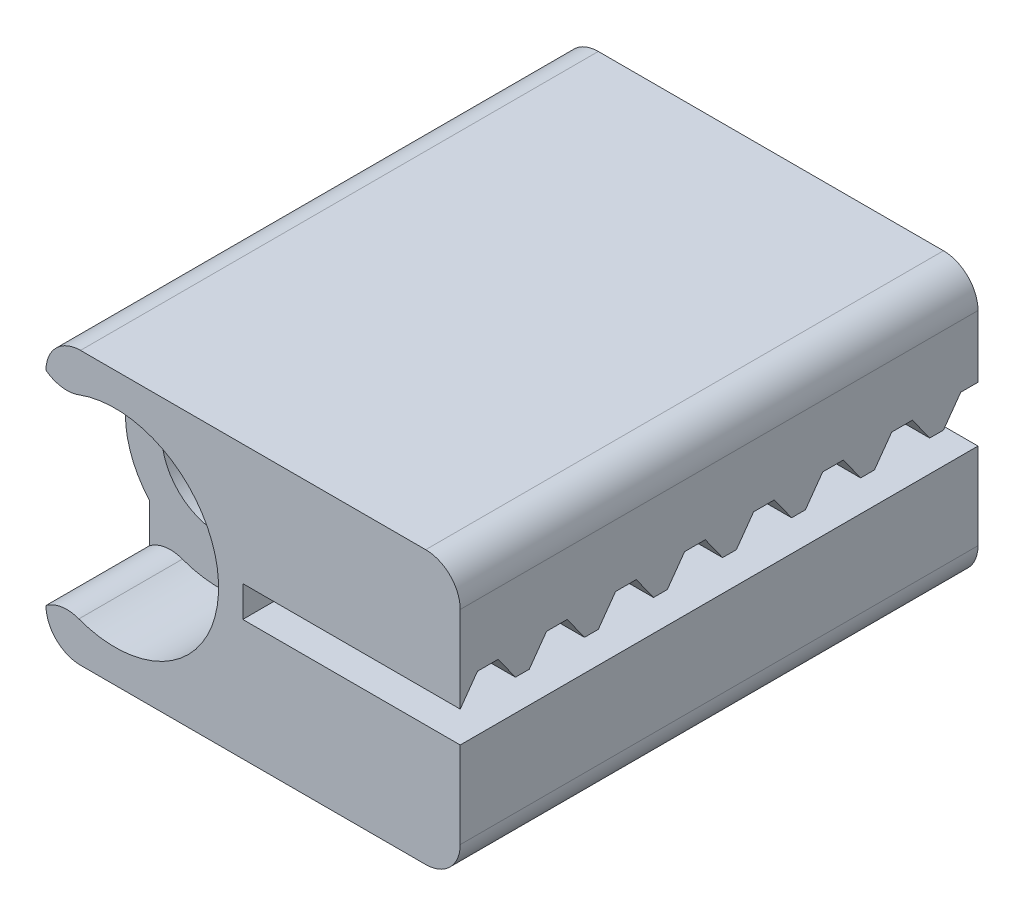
ISO-10303-21;
HEADER;
FILE_DESCRIPTION(('STEP AP214'),'2;1');
FILE_NAME('part.step','',(''),(''),'','','');
FILE_SCHEMA(('AUTOMOTIVE_DESIGN { 1 0 10303 214 1 1 1 1 }'));
ENDSEC;
DATA;
#1=APPLICATION_CONTEXT('core data for automotive mechanical design processes');
#2=APPLICATION_PROTOCOL_DEFINITION('international standard','automotive_design',2000,#1);
#3=PRODUCT_CONTEXT('',#1,'mechanical');
#4=PRODUCT('Part','Part','',(#3));
#5=PRODUCT_RELATED_PRODUCT_CATEGORY('part','',(#4));
#6=PRODUCT_DEFINITION_FORMATION('','',#4);
#7=PRODUCT_DEFINITION_CONTEXT('part definition',#1,'design');
#8=PRODUCT_DEFINITION('design','',#6,#7);
#9=PRODUCT_DEFINITION_SHAPE('','',#8);
#10=(LENGTH_UNIT() NAMED_UNIT(*) SI_UNIT(.MILLI.,.METRE.));
#11=(NAMED_UNIT(*) PLANE_ANGLE_UNIT() SI_UNIT($,.RADIAN.));
#12=(NAMED_UNIT(*) SI_UNIT($,.STERADIAN.) SOLID_ANGLE_UNIT());
#13=UNCERTAINTY_MEASURE_WITH_UNIT(LENGTH_MEASURE(1.E-05),#10,'distance_accuracy_value','');
#14=(GEOMETRIC_REPRESENTATION_CONTEXT(3) GLOBAL_UNCERTAINTY_ASSIGNED_CONTEXT((#13)) GLOBAL_UNIT_ASSIGNED_CONTEXT((#10,
#11,#12)) REPRESENTATION_CONTEXT('',''));
#15=CARTESIAN_POINT('',(0.,0.,0.));
#16=DIRECTION('',(0.,0.,1.));
#17=DIRECTION('',(1.,0.,0.));
#18=AXIS2_PLACEMENT_3D('',#15,#16,#17);
#19=CARTESIAN_POINT('',(6.,0.45,0.));
#20=DIRECTION('',(0.,1.,0.));
#21=DIRECTION('',(0.,0.,1.));
#22=AXIS2_PLACEMENT_3D('',#19,#20,#21);
#23=PLANE('',#22);
#24=DIRECTION('',(0.,0.,1.));
#25=VECTOR('',#24,1.);
#26=CARTESIAN_POINT('',(-0.299999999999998,0.45,0.));
#27=LINE('',#26,#25);
#28=CARTESIAN_POINT('',(-0.299999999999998,0.45,0.999999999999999));
#29=VERTEX_POINT('',#28);
#30=CARTESIAN_POINT('',(-0.299999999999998,0.45,1.4));
#31=VERTEX_POINT('',#30);
#32=EDGE_CURVE('E551',#29,#31,#27,.T.);
#33=ORIENTED_EDGE('',*,*,#32,.F.);
#34=DIRECTION('',(1.,0.,0.));
#35=VECTOR('',#34,1.);
#36=CARTESIAN_POINT('',(-15.3850919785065,0.45,0.999999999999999));
#37=LINE('',#36,#35);
#38=CARTESIAN_POINT('',(6.,0.45,0.999999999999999));
#39=VERTEX_POINT('',#38);
#40=EDGE_CURVE('E496',#29,#39,#37,.T.);
#41=ORIENTED_EDGE('',*,*,#40,.T.);
#42=DIRECTION('',(0.,0.,1.));
#43=VECTOR('',#42,1.);
#44=CARTESIAN_POINT('',(6.,0.45,0.));
#45=LINE('',#44,#43);
#46=CARTESIAN_POINT('',(6.,0.45,1.4));
#47=VERTEX_POINT('',#46);
#48=EDGE_CURVE('E550',#39,#47,#45,.T.);
#49=ORIENTED_EDGE('',*,*,#48,.T.);
#50=DIRECTION('',(1.,0.,0.));
#51=VECTOR('',#50,1.);
#52=CARTESIAN_POINT('',(-15.3850919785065,0.45,1.4));
#53=LINE('',#52,#51);
#54=EDGE_CURVE('E492',#31,#47,#53,.T.);
#55=ORIENTED_EDGE('',*,*,#54,.F.);
#56=EDGE_LOOP('',(#33,#41,#49,#55));
#57=FACE_BOUND('',#56,.T.);
#58=ADVANCED_FACE('F32',(#57),#23,.F.);
#59=CARTESIAN_POINT('',(-0.299999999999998,0.45,3.));
#60=VERTEX_POINT('',#59);
#61=CARTESIAN_POINT('',(-0.299999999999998,0.45,3.4));
#62=VERTEX_POINT('',#61);
#63=EDGE_CURVE('E719',#60,#62,#27,.T.);
#64=ORIENTED_EDGE('',*,*,#63,.F.);
#65=DIRECTION('',(1.,0.,0.));
#66=VECTOR('',#65,1.);
#67=CARTESIAN_POINT('',(-15.3850919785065,0.45,3.));
#68=LINE('',#67,#66);
#69=CARTESIAN_POINT('',(6.,0.45,3.));
#70=VERTEX_POINT('',#69);
#71=EDGE_CURVE('E483',#60,#70,#68,.T.);
#72=ORIENTED_EDGE('',*,*,#71,.T.);
#73=CARTESIAN_POINT('',(6.,0.45,3.4));
#74=VERTEX_POINT('',#73);
#75=EDGE_CURVE('E1234',#70,#74,#45,.T.);
#76=ORIENTED_EDGE('',*,*,#75,.T.);
#77=DIRECTION('',(1.,0.,0.));
#78=VECTOR('',#77,1.);
#79=CARTESIAN_POINT('',(-15.3850919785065,0.45,3.4));
#80=LINE('',#79,#78);
#81=EDGE_CURVE('E479',#62,#74,#80,.T.);
#82=ORIENTED_EDGE('',*,*,#81,.F.);
#83=EDGE_LOOP('',(#64,#72,#76,#82));
#84=FACE_BOUND('',#83,.T.);
#85=ADVANCED_FACE('F793',(#84),#23,.F.);
#86=CARTESIAN_POINT('',(-0.299999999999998,0.45,5.));
#87=VERTEX_POINT('',#86);
#88=CARTESIAN_POINT('',(-0.299999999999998,0.45,5.4));
#89=VERTEX_POINT('',#88);
#90=EDGE_CURVE('E721',#87,#89,#27,.T.);
#91=ORIENTED_EDGE('',*,*,#90,.F.);
#92=DIRECTION('',(1.,0.,0.));
#93=VECTOR('',#92,1.);
#94=CARTESIAN_POINT('',(-15.3850919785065,0.45,5.));
#95=LINE('',#94,#93);
#96=CARTESIAN_POINT('',(6.,0.45,5.));
#97=VERTEX_POINT('',#96);
#98=EDGE_CURVE('E470',#87,#97,#95,.T.);
#99=ORIENTED_EDGE('',*,*,#98,.T.);
#100=CARTESIAN_POINT('',(6.,0.45,5.4));
#101=VERTEX_POINT('',#100);
#102=EDGE_CURVE('E1219',#97,#101,#45,.T.);
#103=ORIENTED_EDGE('',*,*,#102,.T.);
#104=DIRECTION('',(1.,0.,0.));
#105=VECTOR('',#104,1.);
#106=CARTESIAN_POINT('',(-15.3850919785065,0.45,5.4));
#107=LINE('',#106,#105);
#108=EDGE_CURVE('E466',#89,#101,#107,.T.);
#109=ORIENTED_EDGE('',*,*,#108,.F.);
#110=EDGE_LOOP('',(#91,#99,#103,#109));
#111=FACE_BOUND('',#110,.T.);
#112=ADVANCED_FACE('F798',(#111),#23,.F.);
#113=CARTESIAN_POINT('',(-0.299999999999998,0.45,7.));
#114=VERTEX_POINT('',#113);
#115=CARTESIAN_POINT('',(-0.299999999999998,0.45,7.4));
#116=VERTEX_POINT('',#115);
#117=EDGE_CURVE('E724',#114,#116,#27,.T.);
#118=ORIENTED_EDGE('',*,*,#117,.F.);
#119=DIRECTION('',(1.,0.,0.));
#120=VECTOR('',#119,1.);
#121=CARTESIAN_POINT('',(-15.3850919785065,0.45,7.));
#122=LINE('',#121,#120);
#123=CARTESIAN_POINT('',(6.,0.45,7.));
#124=VERTEX_POINT('',#123);
#125=EDGE_CURVE('E457',#114,#124,#122,.T.);
#126=ORIENTED_EDGE('',*,*,#125,.T.);
#127=CARTESIAN_POINT('',(6.,0.45,7.4));
#128=VERTEX_POINT('',#127);
#129=EDGE_CURVE('E1229',#124,#128,#45,.T.);
#130=ORIENTED_EDGE('',*,*,#129,.T.);
#131=DIRECTION('',(1.,0.,0.));
#132=VECTOR('',#131,1.);
#133=CARTESIAN_POINT('',(-15.3850919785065,0.45,7.4));
#134=LINE('',#133,#132);
#135=EDGE_CURVE('E453',#116,#128,#134,.T.);
#136=ORIENTED_EDGE('',*,*,#135,.F.);
#137=EDGE_LOOP('',(#118,#126,#130,#136));
#138=FACE_BOUND('',#137,.T.);
#139=ADVANCED_FACE('F815',(#138),#23,.F.);
#140=CARTESIAN_POINT('',(-0.299999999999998,0.45,9.));
#141=VERTEX_POINT('',#140);
#142=CARTESIAN_POINT('',(-0.299999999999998,0.45,9.4));
#143=VERTEX_POINT('',#142);
#144=EDGE_CURVE('E727',#141,#143,#27,.T.);
#145=ORIENTED_EDGE('',*,*,#144,.F.);
#146=DIRECTION('',(1.,0.,0.));
#147=VECTOR('',#146,1.);
#148=CARTESIAN_POINT('',(-15.3850919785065,0.45,9.));
#149=LINE('',#148,#147);
#150=CARTESIAN_POINT('',(6.,0.45,9.));
#151=VERTEX_POINT('',#150);
#152=EDGE_CURVE('E444',#141,#151,#149,.T.);
#153=ORIENTED_EDGE('',*,*,#152,.T.);
#154=CARTESIAN_POINT('',(6.,0.45,9.4));
#155=VERTEX_POINT('',#154);
#156=EDGE_CURVE('E824',#151,#155,#45,.T.);
#157=ORIENTED_EDGE('',*,*,#156,.T.);
#158=DIRECTION('',(1.,0.,0.));
#159=VECTOR('',#158,1.);
#160=CARTESIAN_POINT('',(-15.3850919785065,0.45,9.4));
#161=LINE('',#160,#159);
#162=EDGE_CURVE('E440',#143,#155,#161,.T.);
#163=ORIENTED_EDGE('',*,*,#162,.F.);
#164=EDGE_LOOP('',(#145,#153,#157,#163));
#165=FACE_BOUND('',#164,.T.);
#166=ADVANCED_FACE('F809',(#165),#23,.F.);
#167=CARTESIAN_POINT('',(-0.299999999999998,0.45,11.));
#168=VERTEX_POINT('',#167);
#169=CARTESIAN_POINT('',(-0.299999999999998,0.45,11.4));
#170=VERTEX_POINT('',#169);
#171=EDGE_CURVE('E549',#168,#170,#27,.T.);
#172=ORIENTED_EDGE('',*,*,#171,.F.);
#173=DIRECTION('',(1.,0.,0.));
#174=VECTOR('',#173,1.);
#175=CARTESIAN_POINT('',(-15.3850919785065,0.45,11.));
#176=LINE('',#175,#174);
#177=CARTESIAN_POINT('',(6.,0.45,11.));
#178=VERTEX_POINT('',#177);
#179=EDGE_CURVE('E431',#168,#178,#176,.T.);
#180=ORIENTED_EDGE('',*,*,#179,.T.);
#181=CARTESIAN_POINT('',(6.,0.45,11.4));
#182=VERTEX_POINT('',#181);
#183=EDGE_CURVE('E555',#178,#182,#45,.T.);
#184=ORIENTED_EDGE('',*,*,#183,.T.);
#185=DIRECTION('',(1.,0.,0.));
#186=VECTOR('',#185,1.);
#187=CARTESIAN_POINT('',(-15.3850919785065,0.45,11.4));
#188=LINE('',#187,#186);
#189=EDGE_CURVE('E427',#170,#182,#188,.T.);
#190=ORIENTED_EDGE('',*,*,#189,.F.);
#191=EDGE_LOOP('',(#172,#180,#184,#190));
#192=FACE_BOUND('',#191,.T.);
#193=ADVANCED_FACE('F735',(#192),#23,.F.);
#194=CARTESIAN_POINT('',(6.,-2.95,15.));
#195=DIRECTION('',(-1.,0.,0.));
#196=DIRECTION('',(0.,-1.,0.));
#197=AXIS2_PLACEMENT_3D('',#194,#195,#196);
#198=PLANE('',#197);
#199=DIRECTION('',(0.,-0.813733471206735,0.581238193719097));
#200=VECTOR('',#199,1.);
#201=CARTESIAN_POINT('',(6.,0.45,0.999999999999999));
#202=LINE('',#201,#200);
#203=CARTESIAN_POINT('',(6.,1.15,0.499999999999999));
#204=VERTEX_POINT('',#203);
#205=EDGE_CURVE('E403',#204,#39,#202,.T.);
#206=ORIENTED_EDGE('',*,*,#205,.F.);
#207=DIRECTION('',(0.,0.,1.));
#208=VECTOR('',#207,1.);
#209=CARTESIAN_POINT('',(6.,1.15,0.499999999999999));
#210=LINE('',#209,#208);
#211=CARTESIAN_POINT('',(6.,1.15,0.));
#212=VERTEX_POINT('',#211);
#213=EDGE_CURVE('E405',#212,#204,#210,.T.);
#214=ORIENTED_EDGE('',*,*,#213,.F.);
#215=DIRECTION('',(0.,1.,0.));
#216=VECTOR('',#215,1.);
#217=CARTESIAN_POINT('',(6.,-2.95,0.));
#218=LINE('',#217,#216);
#219=CARTESIAN_POINT('',(6.,2.95,0.));
#220=VERTEX_POINT('',#219);
#221=EDGE_CURVE('E602',#212,#220,#218,.T.);
#222=ORIENTED_EDGE('',*,*,#221,.T.);
#223=DIRECTION('',(0.,0.,-1.));
#224=VECTOR('',#223,1.);
#225=CARTESIAN_POINT('',(6.,2.95,15.));
#226=LINE('',#225,#224);
#227=CARTESIAN_POINT('',(6.,2.95,15.));
#228=VERTEX_POINT('',#227);
#229=EDGE_CURVE('E638',#228,#220,#226,.T.);
#230=ORIENTED_EDGE('',*,*,#229,.F.);
#231=DIRECTION('',(0.,1.,0.));
#232=VECTOR('',#231,1.);
#233=CARTESIAN_POINT('',(6.,-2.95,15.));
#234=LINE('',#233,#232);
#235=CARTESIAN_POINT('',(6.,0.45,15.));
#236=VERTEX_POINT('',#235);
#237=EDGE_CURVE('E350',#236,#228,#234,.T.);
#238=ORIENTED_EDGE('',*,*,#237,.F.);
#239=DIRECTION('',(0.,-0.813733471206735,0.581238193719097));
#240=VECTOR('',#239,1.);
#241=CARTESIAN_POINT('',(6.,0.45,15.));
#242=LINE('',#241,#240);
#243=CARTESIAN_POINT('',(6.,1.15,14.5));
#244=VERTEX_POINT('',#243);
#245=EDGE_CURVE('E328',#244,#236,#242,.T.);
#246=ORIENTED_EDGE('',*,*,#245,.F.);
#247=DIRECTION('',(0.,0.,1.));
#248=VECTOR('',#247,1.);
#249=CARTESIAN_POINT('',(6.,1.15,14.5));
#250=LINE('',#249,#248);
#251=CARTESIAN_POINT('',(6.,1.15,13.9));
#252=VERTEX_POINT('',#251);
#253=EDGE_CURVE('E337',#252,#244,#250,.T.);
#254=ORIENTED_EDGE('',*,*,#253,.F.);
#255=DIRECTION('',(0.,0.813733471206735,0.581238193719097));
#256=VECTOR('',#255,1.);
#257=CARTESIAN_POINT('',(6.,1.15,13.9));
#258=LINE('',#257,#256);
#259=CARTESIAN_POINT('',(6.,0.45,13.4));
#260=VERTEX_POINT('',#259);
#261=EDGE_CURVE('E344',#260,#252,#258,.T.);
#262=ORIENTED_EDGE('',*,*,#261,.F.);
#263=CARTESIAN_POINT('',(6.,0.45,13.));
#264=VERTEX_POINT('',#263);
#265=EDGE_CURVE('E552',#264,#260,#45,.T.);
#266=ORIENTED_EDGE('',*,*,#265,.F.);
#267=DIRECTION('',(0.,-0.813733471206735,0.581238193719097));
#268=VECTOR('',#267,1.);
#269=CARTESIAN_POINT('',(6.,0.45,13.));
#270=LINE('',#269,#268);
#271=CARTESIAN_POINT('',(6.,1.15,12.5));
#272=VERTEX_POINT('',#271);
#273=EDGE_CURVE('E47',#272,#264,#270,.T.);
#274=ORIENTED_EDGE('',*,*,#273,.F.);
#275=DIRECTION('',(0.,0.,1.));
#276=VECTOR('',#275,1.);
#277=CARTESIAN_POINT('',(6.,1.15,12.5));
#278=LINE('',#277,#276);
#279=CARTESIAN_POINT('',(6.,1.15,11.9));
#280=VERTEX_POINT('',#279);
#281=EDGE_CURVE('E358',#280,#272,#278,.T.);
#282=ORIENTED_EDGE('',*,*,#281,.F.);
#283=DIRECTION('',(0.,0.813733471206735,0.581238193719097));
#284=VECTOR('',#283,1.);
#285=CARTESIAN_POINT('',(6.,1.15,11.9));
#286=LINE('',#285,#284);
#287=EDGE_CURVE('E361',#182,#280,#286,.T.);
#288=ORIENTED_EDGE('',*,*,#287,.F.);
#289=ORIENTED_EDGE('',*,*,#183,.F.);
#290=DIRECTION('',(0.,-0.813733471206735,0.581238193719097));
#291=VECTOR('',#290,1.);
#292=CARTESIAN_POINT('',(6.,0.45,11.));
#293=LINE('',#292,#291);
#294=CARTESIAN_POINT('',(6.,1.15,10.5));
#295=VERTEX_POINT('',#294);
#296=EDGE_CURVE('E55',#295,#178,#293,.T.);
#297=ORIENTED_EDGE('',*,*,#296,.F.);
#298=DIRECTION('',(0.,0.,1.));
#299=VECTOR('',#298,1.);
#300=CARTESIAN_POINT('',(6.,1.15,10.5));
#301=LINE('',#300,#299);
#302=CARTESIAN_POINT('',(6.,1.15,9.9));
#303=VERTEX_POINT('',#302);
#304=EDGE_CURVE('E365',#303,#295,#301,.T.);
#305=ORIENTED_EDGE('',*,*,#304,.F.);
#306=DIRECTION('',(0.,0.813733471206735,0.581238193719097));
#307=VECTOR('',#306,1.);
#308=CARTESIAN_POINT('',(6.,1.15,9.9));
#309=LINE('',#308,#307);
#310=EDGE_CURVE('E368',#155,#303,#309,.T.);
#311=ORIENTED_EDGE('',*,*,#310,.F.);
#312=ORIENTED_EDGE('',*,*,#156,.F.);
#313=DIRECTION('',(0.,-0.813733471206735,0.581238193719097));
#314=VECTOR('',#313,1.);
#315=CARTESIAN_POINT('',(6.,0.45,9.));
#316=LINE('',#315,#314);
#317=CARTESIAN_POINT('',(6.,1.15,8.5));
#318=VERTEX_POINT('',#317);
#319=EDGE_CURVE('E371',#318,#151,#316,.T.);
#320=ORIENTED_EDGE('',*,*,#319,.F.);
#321=DIRECTION('',(0.,0.,1.));
#322=VECTOR('',#321,1.);
#323=CARTESIAN_POINT('',(6.,1.15,8.5));
#324=LINE('',#323,#322);
#325=CARTESIAN_POINT('',(6.,1.15,7.9));
#326=VERTEX_POINT('',#325);
#327=EDGE_CURVE('E373',#326,#318,#324,.T.);
#328=ORIENTED_EDGE('',*,*,#327,.F.);
#329=DIRECTION('',(0.,0.813733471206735,0.581238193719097));
#330=VECTOR('',#329,1.);
#331=CARTESIAN_POINT('',(6.,1.15,7.9));
#332=LINE('',#331,#330);
#333=EDGE_CURVE('E376',#128,#326,#332,.T.);
#334=ORIENTED_EDGE('',*,*,#333,.F.);
#335=ORIENTED_EDGE('',*,*,#129,.F.);
#336=DIRECTION('',(0.,-0.813733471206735,0.581238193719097));
#337=VECTOR('',#336,1.);
#338=CARTESIAN_POINT('',(6.,0.45,7.));
#339=LINE('',#338,#337);
#340=CARTESIAN_POINT('',(6.,1.15,6.5));
#341=VERTEX_POINT('',#340);
#342=EDGE_CURVE('E379',#341,#124,#339,.T.);
#343=ORIENTED_EDGE('',*,*,#342,.F.);
#344=DIRECTION('',(0.,0.,1.));
#345=VECTOR('',#344,1.);
#346=CARTESIAN_POINT('',(6.,1.15,6.5));
#347=LINE('',#346,#345);
#348=CARTESIAN_POINT('',(6.,1.15,5.9));
#349=VERTEX_POINT('',#348);
#350=EDGE_CURVE('E381',#349,#341,#347,.T.);
#351=ORIENTED_EDGE('',*,*,#350,.F.);
#352=DIRECTION('',(0.,0.813733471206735,0.581238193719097));
#353=VECTOR('',#352,1.);
#354=CARTESIAN_POINT('',(6.,1.15,5.9));
#355=LINE('',#354,#353);
#356=EDGE_CURVE('E384',#101,#349,#355,.T.);
#357=ORIENTED_EDGE('',*,*,#356,.F.);
#358=ORIENTED_EDGE('',*,*,#102,.F.);
#359=DIRECTION('',(0.,-0.813733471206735,0.581238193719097));
#360=VECTOR('',#359,1.);
#361=CARTESIAN_POINT('',(6.,0.45,5.));
#362=LINE('',#361,#360);
#363=CARTESIAN_POINT('',(6.,1.15,4.5));
#364=VERTEX_POINT('',#363);
#365=EDGE_CURVE('E387',#364,#97,#362,.T.);
#366=ORIENTED_EDGE('',*,*,#365,.F.);
#367=DIRECTION('',(0.,0.,1.));
#368=VECTOR('',#367,1.);
#369=CARTESIAN_POINT('',(6.,1.15,4.5));
#370=LINE('',#369,#368);
#371=CARTESIAN_POINT('',(6.,1.15,3.9));
#372=VERTEX_POINT('',#371);
#373=EDGE_CURVE('E389',#372,#364,#370,.T.);
#374=ORIENTED_EDGE('',*,*,#373,.F.);
#375=DIRECTION('',(0.,0.813733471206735,0.581238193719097));
#376=VECTOR('',#375,1.);
#377=CARTESIAN_POINT('',(6.,1.15,3.9));
#378=LINE('',#377,#376);
#379=EDGE_CURVE('E392',#74,#372,#378,.T.);
#380=ORIENTED_EDGE('',*,*,#379,.F.);
#381=ORIENTED_EDGE('',*,*,#75,.F.);
#382=DIRECTION('',(0.,-0.813733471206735,0.581238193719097));
#383=VECTOR('',#382,1.);
#384=CARTESIAN_POINT('',(6.,0.45,3.));
#385=LINE('',#384,#383);
#386=CARTESIAN_POINT('',(6.,1.15,2.5));
#387=VERTEX_POINT('',#386);
#388=EDGE_CURVE('E395',#387,#70,#385,.T.);
#389=ORIENTED_EDGE('',*,*,#388,.F.);
#390=DIRECTION('',(0.,0.,1.));
#391=VECTOR('',#390,1.);
#392=CARTESIAN_POINT('',(6.,1.15,2.5));
#393=LINE('',#392,#391);
#394=CARTESIAN_POINT('',(6.,1.15,1.9));
#395=VERTEX_POINT('',#394);
#396=EDGE_CURVE('E397',#395,#387,#393,.T.);
#397=ORIENTED_EDGE('',*,*,#396,.F.);
#398=DIRECTION('',(0.,0.813733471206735,0.581238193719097));
#399=VECTOR('',#398,1.);
#400=CARTESIAN_POINT('',(6.,1.15,1.9));
#401=LINE('',#400,#399);
#402=EDGE_CURVE('E400',#47,#395,#401,.T.);
#403=ORIENTED_EDGE('',*,*,#402,.F.);
#404=ORIENTED_EDGE('',*,*,#48,.F.);
#405=EDGE_LOOP('',(#206,#214,#222,#230,#238,#246,#254,#262,#266,#274,#282,#288,#289,#297,#305,
#311,#312,#320,#328,#334,#335,#343,#351,#357,#358,#366,#374,#380,#381,#389,#397,#403,#404));
#406=FACE_BOUND('',#405,.T.);
#407=ADVANCED_FACE('F348',(#406),#198,.F.);
#408=CARTESIAN_POINT('',(-4.,0.,15.));
#409=DIRECTION('',(0.,0.,-1.));
#410=DIRECTION('',(-1.,0.,0.));
#411=AXIS2_PLACEMENT_3D('',#408,#409,#410);
#412=CYLINDRICAL_SURFACE('',#411,2.7);
#413=CARTESIAN_POINT('',(-4.,0.,12.));
#414=DIRECTION('',(0.,0.,1.));
#415=DIRECTION('',(1.,0.,0.));
#416=AXIS2_PLACEMENT_3D('',#413,#414,#415);
#417=CIRCLE('',#416,2.7);
#418=CARTESIAN_POINT('',(-6.,1.8138357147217,12.));
#419=VERTEX_POINT('',#418);
#420=CARTESIAN_POINT('',(-6.,-1.81383571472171,12.));
#421=VERTEX_POINT('',#420);
#422=EDGE_CURVE('E569',#419,#421,#417,.T.);
#423=ORIENTED_EDGE('',*,*,#422,.F.);
#424=DIRECTION('',(0.,0.,-1.));
#425=VECTOR('',#424,1.);
#426=CARTESIAN_POINT('',(-6.,1.8138357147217,15.));
#427=LINE('',#426,#425);
#428=CARTESIAN_POINT('',(-6.,1.8138357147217,0.));
#429=VERTEX_POINT('',#428);
#430=EDGE_CURVE('E626',#419,#429,#427,.T.);
#431=ORIENTED_EDGE('',*,*,#430,.T.);
#432=CARTESIAN_POINT('',(-4.,0.,0.));
#433=DIRECTION('',(0.,0.,1.));
#434=DIRECTION('',(1.,0.,0.));
#435=AXIS2_PLACEMENT_3D('',#432,#433,#434);
#436=CIRCLE('',#435,2.7);
#437=CARTESIAN_POINT('',(-6.,-1.81383571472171,0.));
#438=VERTEX_POINT('',#437);
#439=EDGE_CURVE('E616',#429,#438,#436,.T.);
#440=ORIENTED_EDGE('',*,*,#439,.T.);
#441=DIRECTION('',(0.,0.,-1.));
#442=VECTOR('',#441,1.);
#443=CARTESIAN_POINT('',(-6.,-1.81383571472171,15.));
#444=LINE('',#443,#442);
#445=EDGE_CURVE('E624',#421,#438,#444,.T.);
#446=ORIENTED_EDGE('',*,*,#445,.F.);
#447=EDGE_LOOP('',(#423,#431,#440,#446));
#448=FACE_BOUND('',#447,.T.);
#449=ADVANCED_FACE('F774',(#448),#412,.T.);
#450=CARTESIAN_POINT('',(-4.,0.,15.));
#451=DIRECTION('',(0.,0.,-1.));
#452=DIRECTION('',(-1.,0.,0.));
#453=AXIS2_PLACEMENT_3D('',#450,#451,#452);
#454=CYLINDRICAL_SURFACE('',#453,1.65);
#455=CARTESIAN_POINT('',(-4.,0.,0.));
#456=DIRECTION('',(0.,0.,1.));
#457=DIRECTION('',(1.,0.,0.));
#458=AXIS2_PLACEMENT_3D('',#455,#456,#457);
#459=CIRCLE('',#458,1.65);
#460=CARTESIAN_POINT('',(-2.35,0.,0.));
#461=VERTEX_POINT('',#460);
#462=EDGE_CURVE('E573',#461,#461,#459,.T.);
#463=ORIENTED_EDGE('',*,*,#462,.F.);
#464=EDGE_LOOP('',(#463));
#465=FACE_BOUND('',#464,.T.);
#466=CARTESIAN_POINT('',(-4.,0.,12.));
#467=DIRECTION('',(0.,0.,1.));
#468=DIRECTION('',(1.,0.,0.));
#469=AXIS2_PLACEMENT_3D('',#466,#467,#468);
#470=CIRCLE('',#469,1.65);
#471=CARTESIAN_POINT('',(-2.35,0.,12.));
#472=VERTEX_POINT('',#471);
#473=EDGE_CURVE('E563',#472,#472,#470,.T.);
#474=ORIENTED_EDGE('',*,*,#473,.T.);
#475=EDGE_LOOP('',(#474));
#476=FACE_BOUND('',#475,.T.);
#477=ADVANCED_FACE('F1149',(#465,#476),#454,.F.);
#478=CARTESIAN_POINT('',(-5.,-2.95,15.));
#479=DIRECTION('',(0.,0.,-1.));
#480=DIRECTION('',(-1.,0.,0.));
#481=AXIS2_PLACEMENT_3D('',#478,#479,#480);
#482=PLANE('',#481);
#483=DIRECTION('',(0.,-1.,0.));
#484=VECTOR('',#483,1.);
#485=CARTESIAN_POINT('',(-0.299999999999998,0.45,15.));
#486=LINE('',#485,#484);
#487=CARTESIAN_POINT('',(-0.299999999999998,0.45,15.));
#488=VERTEX_POINT('',#487);
#489=CARTESIAN_POINT('',(-0.299999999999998,-0.45,15.));
#490=VERTEX_POINT('',#489);
#491=EDGE_CURVE('E409',#488,#490,#486,.T.);
#492=ORIENTED_EDGE('',*,*,#491,.F.);
#493=DIRECTION('',(-1.,0.,0.));
#494=VECTOR('',#493,1.);
#495=CARTESIAN_POINT('',(6.,0.45,15.));
#496=LINE('',#495,#494);
#497=EDGE_CURVE('E537',#236,#488,#496,.T.);
#498=ORIENTED_EDGE('',*,*,#497,.F.);
#499=ORIENTED_EDGE('',*,*,#237,.T.);
#500=CARTESIAN_POINT('',(5.,2.95,15.));
#501=DIRECTION('',(0.,0.,1.));
#502=DIRECTION('',(-1.,0.,0.));
#503=AXIS2_PLACEMENT_3D('',#500,#501,#502);
#504=CIRCLE('',#503,1.);
#505=CARTESIAN_POINT('',(5.,3.95,15.));
#506=VERTEX_POINT('',#505);
#507=EDGE_CURVE('E588',#228,#506,#504,.T.);
#508=ORIENTED_EDGE('',*,*,#507,.T.);
#509=DIRECTION('',(-1.,0.,0.));
#510=VECTOR('',#509,1.);
#511=CARTESIAN_POINT('',(-5.,3.95,15.));
#512=LINE('',#511,#510);
#513=CARTESIAN_POINT('',(-5.,3.95,15.));
#514=VERTEX_POINT('',#513);
#515=EDGE_CURVE('E590',#506,#514,#512,.T.);
#516=ORIENTED_EDGE('',*,*,#515,.T.);
#517=CARTESIAN_POINT('',(-5.,2.95,15.));
#518=DIRECTION('',(0.,0.,1.));
#519=DIRECTION('',(-1.,0.,0.));
#520=AXIS2_PLACEMENT_3D('',#517,#518,#519);
#521=CIRCLE('',#520,1.);
#522=CARTESIAN_POINT('',(-6.,2.95,15.));
#523=VERTEX_POINT('',#522);
#524=EDGE_CURVE('E592',#514,#523,#521,.T.);
#525=ORIENTED_EDGE('',*,*,#524,.T.);
#526=CARTESIAN_POINT('',(-5.39733424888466,3.74799372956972,15.));
#527=DIRECTION('',(0.,0.,-1.));
#528=DIRECTION('',(-1.,0.,0.));
#529=AXIS2_PLACEMENT_3D('',#526,#527,#528);
#530=CIRCLE('',#529,1.);
#531=CARTESIAN_POINT('',(-5.0480006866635,2.81099529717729,15.));
#532=VERTEX_POINT('',#531);
#533=EDGE_CURVE('E656',#523,#532,#530,.F.);
#534=ORIENTED_EDGE('',*,*,#533,.T.);
#535=CARTESIAN_POINT('',(-4.,0.,15.));
#536=DIRECTION('',(0.,0.,1.));
#537=DIRECTION('',(1.,0.,0.));
#538=AXIS2_PLACEMENT_3D('',#535,#536,#537);
#539=CIRCLE('',#538,3.);
#540=CARTESIAN_POINT('',(-5.0480006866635,-2.81099529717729,15.));
#541=VERTEX_POINT('',#540);
#542=EDGE_CURVE('E564',#541,#532,#539,.T.);
#543=ORIENTED_EDGE('',*,*,#542,.F.);
#544=CARTESIAN_POINT('',(-5.39733424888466,-3.74799372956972,15.));
#545=DIRECTION('',(0.,0.,-1.));
#546=DIRECTION('',(-1.,0.,0.));
#547=AXIS2_PLACEMENT_3D('',#544,#545,#546);
#548=CIRCLE('',#547,1.);
#549=CARTESIAN_POINT('',(-6.,-2.95,15.));
#550=VERTEX_POINT('',#549);
#551=EDGE_CURVE('E658',#541,#550,#548,.F.);
#552=ORIENTED_EDGE('',*,*,#551,.T.);
#553=CARTESIAN_POINT('',(-5.,-2.95,15.));
#554=DIRECTION('',(0.,0.,1.));
#555=DIRECTION('',(-1.,0.,0.));
#556=AXIS2_PLACEMENT_3D('',#553,#554,#555);
#557=CIRCLE('',#556,1.);
#558=CARTESIAN_POINT('',(-5.,-3.95,15.));
#559=VERTEX_POINT('',#558);
#560=EDGE_CURVE('E577',#550,#559,#557,.T.);
#561=ORIENTED_EDGE('',*,*,#560,.T.);
#562=DIRECTION('',(1.,0.,0.));
#563=VECTOR('',#562,1.);
#564=CARTESIAN_POINT('',(-5.,-3.95,15.));
#565=LINE('',#564,#563);
#566=CARTESIAN_POINT('',(5.,-3.95,15.));
#567=VERTEX_POINT('',#566);
#568=EDGE_CURVE('E580',#559,#567,#565,.T.);
#569=ORIENTED_EDGE('',*,*,#568,.T.);
#570=CARTESIAN_POINT('',(5.,-2.95,15.));
#571=DIRECTION('',(0.,0.,1.));
#572=DIRECTION('',(1.,0.,0.));
#573=AXIS2_PLACEMENT_3D('',#570,#571,#572);
#574=CIRCLE('',#573,1.);
#575=CARTESIAN_POINT('',(6.,-2.95,15.));
#576=VERTEX_POINT('',#575);
#577=EDGE_CURVE('E583',#567,#576,#574,.T.);
#578=ORIENTED_EDGE('',*,*,#577,.T.);
#579=CARTESIAN_POINT('',(6.,-0.45,15.));
#580=VERTEX_POINT('',#579);
#581=EDGE_CURVE('E585',#576,#580,#234,.T.);
#582=ORIENTED_EDGE('',*,*,#581,.T.);
#583=DIRECTION('',(1.,0.,0.));
#584=VECTOR('',#583,1.);
#585=CARTESIAN_POINT('',(6.,-0.45,15.));
#586=LINE('',#585,#584);
#587=EDGE_CURVE('E543',#490,#580,#586,.T.);
#588=ORIENTED_EDGE('',*,*,#587,.F.);
#589=EDGE_LOOP('',(#492,#498,#499,#508,#516,#525,#534,#543,#552,#561,#569,#578,#582,#588));
#590=FACE_BOUND('',#589,.T.);
#591=ADVANCED_FACE('F678',(#590),#482,.F.);
#592=CARTESIAN_POINT('',(-5.,-2.95,0.));
#593=DIRECTION('',(0.,0.,-1.));
#594=DIRECTION('',(-1.,0.,0.));
#595=AXIS2_PLACEMENT_3D('',#592,#593,#594);
#596=PLANE('',#595);
#597=DIRECTION('',(1.,0.,0.));
#598=VECTOR('',#597,1.);
#599=CARTESIAN_POINT('',(-15.3850919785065,1.15,0.));
#600=LINE('',#599,#598);
#601=CARTESIAN_POINT('',(-0.299999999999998,1.15,0.));
#602=VERTEX_POINT('',#601);
#603=EDGE_CURVE('E351',#602,#212,#600,.T.);
#604=ORIENTED_EDGE('',*,*,#603,.F.);
#605=DIRECTION('',(0.,-1.,0.));
#606=VECTOR('',#605,1.);
#607=CARTESIAN_POINT('',(-0.299999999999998,0.45,0.));
#608=LINE('',#607,#606);
#609=CARTESIAN_POINT('',(-0.299999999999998,-0.45,0.));
#610=VERTEX_POINT('',#609);
#611=EDGE_CURVE('E533',#602,#610,#608,.T.);
#612=ORIENTED_EDGE('',*,*,#611,.T.);
#613=DIRECTION('',(1.,0.,0.));
#614=VECTOR('',#613,1.);
#615=CARTESIAN_POINT('',(6.,-0.45,0.));
#616=LINE('',#615,#614);
#617=CARTESIAN_POINT('',(6.,-0.45,0.));
#618=VERTEX_POINT('',#617);
#619=EDGE_CURVE('E536',#610,#618,#616,.T.);
#620=ORIENTED_EDGE('',*,*,#619,.T.);
#621=CARTESIAN_POINT('',(6.,-2.95,0.));
#622=VERTEX_POINT('',#621);
#623=EDGE_CURVE('E603',#622,#618,#218,.T.);
#624=ORIENTED_EDGE('',*,*,#623,.F.);
#625=CARTESIAN_POINT('',(5.,-2.95,0.));
#626=DIRECTION('',(0.,0.,1.));
#627=DIRECTION('',(1.,0.,0.));
#628=AXIS2_PLACEMENT_3D('',#625,#626,#627);
#629=CIRCLE('',#628,1.);
#630=CARTESIAN_POINT('',(5.,-3.95,0.));
#631=VERTEX_POINT('',#630);
#632=EDGE_CURVE('E600',#631,#622,#629,.T.);
#633=ORIENTED_EDGE('',*,*,#632,.F.);
#634=DIRECTION('',(1.,0.,0.));
#635=VECTOR('',#634,1.);
#636=CARTESIAN_POINT('',(-5.,-3.95,0.));
#637=LINE('',#636,#635);
#638=CARTESIAN_POINT('',(-5.,-3.95,0.));
#639=VERTEX_POINT('',#638);
#640=EDGE_CURVE('E598',#639,#631,#637,.T.);
#641=ORIENTED_EDGE('',*,*,#640,.F.);
#642=CARTESIAN_POINT('',(-5.,-2.95,0.));
#643=DIRECTION('',(0.,0.,1.));
#644=DIRECTION('',(-1.,0.,0.));
#645=AXIS2_PLACEMENT_3D('',#642,#643,#644);
#646=CIRCLE('',#645,1.);
#647=CARTESIAN_POINT('',(-6.,-2.95,0.));
#648=VERTEX_POINT('',#647);
#649=EDGE_CURVE('E576',#648,#639,#646,.T.);
#650=ORIENTED_EDGE('',*,*,#649,.F.);
#651=DIRECTION('',(0.,-1.,0.));
#652=VECTOR('',#651,1.);
#653=CARTESIAN_POINT('',(-6.,-2.95,0.));
#654=LINE('',#653,#652);
#655=EDGE_CURVE('E581',#438,#648,#654,.T.);
#656=ORIENTED_EDGE('',*,*,#655,.F.);
#657=ORIENTED_EDGE('',*,*,#439,.F.);
#658=DIRECTION('',(0.,-1.,0.));
#659=VECTOR('',#658,1.);
#660=CARTESIAN_POINT('',(-6.,1.8138357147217,0.));
#661=LINE('',#660,#659);
#662=CARTESIAN_POINT('',(-6.,2.95,0.));
#663=VERTEX_POINT('',#662);
#664=EDGE_CURVE('E613',#663,#429,#661,.T.);
#665=ORIENTED_EDGE('',*,*,#664,.F.);
#666=CARTESIAN_POINT('',(-5.,2.95,0.));
#667=DIRECTION('',(0.,0.,1.));
#668=DIRECTION('',(-1.,0.,0.));
#669=AXIS2_PLACEMENT_3D('',#666,#667,#668);
#670=CIRCLE('',#669,1.);
#671=CARTESIAN_POINT('',(-5.,3.95,0.));
#672=VERTEX_POINT('',#671);
#673=EDGE_CURVE('E610',#672,#663,#670,.T.);
#674=ORIENTED_EDGE('',*,*,#673,.F.);
#675=DIRECTION('',(-1.,0.,0.));
#676=VECTOR('',#675,1.);
#677=CARTESIAN_POINT('',(-5.,3.95,0.));
#678=LINE('',#677,#676);
#679=CARTESIAN_POINT('',(5.,3.95,0.));
#680=VERTEX_POINT('',#679);
#681=EDGE_CURVE('E608',#680,#672,#678,.T.);
#682=ORIENTED_EDGE('',*,*,#681,.F.);
#683=CARTESIAN_POINT('',(5.,2.95,0.));
#684=DIRECTION('',(0.,0.,1.));
#685=DIRECTION('',(-1.,0.,0.));
#686=AXIS2_PLACEMENT_3D('',#683,#684,#685);
#687=CIRCLE('',#686,1.);
#688=EDGE_CURVE('E606',#220,#680,#687,.T.);
#689=ORIENTED_EDGE('',*,*,#688,.F.);
#690=ORIENTED_EDGE('',*,*,#221,.F.);
#691=EDGE_LOOP('',(#604,#612,#620,#624,#633,#641,#650,#656,#657,#665,#674,#682,#689,#690));
#692=FACE_BOUND('',#691,.T.);
#693=ORIENTED_EDGE('',*,*,#462,.T.);
#694=EDGE_LOOP('',(#693));
#695=FACE_BOUND('',#694,.T.);
#696=ADVANCED_FACE('F701',(#692,#695),#596,.T.);
#697=CARTESIAN_POINT('',(-5.,-2.95,15.));
#698=DIRECTION('',(0.,0.,-1.));
#699=DIRECTION('',(-1.,0.,0.));
#700=AXIS2_PLACEMENT_3D('',#697,#698,#699);
#701=CYLINDRICAL_SURFACE('',#700,1.);
#702=ORIENTED_EDGE('',*,*,#649,.T.);
#703=DIRECTION('',(0.,0.,-1.));
#704=VECTOR('',#703,1.);
#705=CARTESIAN_POINT('',(-5.,-3.95,15.));
#706=LINE('',#705,#704);
#707=EDGE_CURVE('E647',#559,#639,#706,.T.);
#708=ORIENTED_EDGE('',*,*,#707,.F.);
#709=ORIENTED_EDGE('',*,*,#560,.F.);
#710=DIRECTION('',(0.,0.,-1.));
#711=VECTOR('',#710,1.);
#712=CARTESIAN_POINT('',(-6.,-2.95,15.));
#713=LINE('',#712,#711);
#714=CARTESIAN_POINT('',(-6.,-2.95,12.));
#715=VERTEX_POINT('',#714);
#716=EDGE_CURVE('E621',#550,#715,#713,.T.);
#717=ORIENTED_EDGE('',*,*,#716,.T.);
#718=EDGE_CURVE('E595',#715,#648,#713,.T.);
#719=ORIENTED_EDGE('',*,*,#718,.T.);
#720=EDGE_LOOP('',(#702,#708,#709,#717,#719));
#721=FACE_BOUND('',#720,.T.);
#722=ADVANCED_FACE('F681',(#721),#701,.T.);
#723=CARTESIAN_POINT('',(-5.,-3.95,15.));
#724=DIRECTION('',(0.,1.,0.));
#725=DIRECTION('',(0.,0.,1.));
#726=AXIS2_PLACEMENT_3D('',#723,#724,#725);
#727=PLANE('',#726);
#728=ORIENTED_EDGE('',*,*,#640,.T.);
#729=DIRECTION('',(0.,0.,-1.));
#730=VECTOR('',#729,1.);
#731=CARTESIAN_POINT('',(5.,-3.95,15.));
#732=LINE('',#731,#730);
#733=EDGE_CURVE('E644',#567,#631,#732,.T.);
#734=ORIENTED_EDGE('',*,*,#733,.F.);
#735=ORIENTED_EDGE('',*,*,#568,.F.);
#736=ORIENTED_EDGE('',*,*,#707,.T.);
#737=EDGE_LOOP('',(#728,#734,#735,#736));
#738=FACE_BOUND('',#737,.T.);
#739=ADVANCED_FACE('F684',(#738),#727,.F.);
#740=CARTESIAN_POINT('',(5.,-2.95,15.));
#741=DIRECTION('',(0.,0.,-1.));
#742=DIRECTION('',(-1.,0.,0.));
#743=AXIS2_PLACEMENT_3D('',#740,#741,#742);
#744=CYLINDRICAL_SURFACE('',#743,1.);
#745=ORIENTED_EDGE('',*,*,#632,.T.);
#746=DIRECTION('',(0.,0.,-1.));
#747=VECTOR('',#746,1.);
#748=CARTESIAN_POINT('',(6.,-2.95,15.));
#749=LINE('',#748,#747);
#750=EDGE_CURVE('E641',#576,#622,#749,.T.);
#751=ORIENTED_EDGE('',*,*,#750,.F.);
#752=ORIENTED_EDGE('',*,*,#577,.F.);
#753=ORIENTED_EDGE('',*,*,#733,.T.);
#754=EDGE_LOOP('',(#745,#751,#752,#753));
#755=FACE_BOUND('',#754,.T.);
#756=ADVANCED_FACE('F691',(#755),#744,.T.);
#757=ORIENTED_EDGE('',*,*,#623,.T.);
#758=DIRECTION('',(0.,0.,1.));
#759=VECTOR('',#758,1.);
#760=CARTESIAN_POINT('',(6.,-0.45,0.));
#761=LINE('',#760,#759);
#762=EDGE_CURVE('E556',#618,#580,#761,.T.);
#763=ORIENTED_EDGE('',*,*,#762,.T.);
#764=ORIENTED_EDGE('',*,*,#581,.F.);
#765=ORIENTED_EDGE('',*,*,#750,.T.);
#766=EDGE_LOOP('',(#757,#763,#764,#765));
#767=FACE_BOUND('',#766,.T.);
#768=ADVANCED_FACE('F695',(#767),#198,.F.);
#769=CARTESIAN_POINT('',(5.,2.95,15.));
#770=DIRECTION('',(0.,0.,-1.));
#771=DIRECTION('',(-1.,0.,0.));
#772=AXIS2_PLACEMENT_3D('',#769,#770,#771);
#773=CYLINDRICAL_SURFACE('',#772,1.);
#774=ORIENTED_EDGE('',*,*,#688,.T.);
#775=DIRECTION('',(0.,0.,-1.));
#776=VECTOR('',#775,1.);
#777=CARTESIAN_POINT('',(5.,3.95,15.));
#778=LINE('',#777,#776);
#779=EDGE_CURVE('E635',#506,#680,#778,.T.);
#780=ORIENTED_EDGE('',*,*,#779,.F.);
#781=ORIENTED_EDGE('',*,*,#507,.F.);
#782=ORIENTED_EDGE('',*,*,#229,.T.);
#783=EDGE_LOOP('',(#774,#780,#781,#782));
#784=FACE_BOUND('',#783,.T.);
#785=ADVANCED_FACE('F757',(#784),#773,.T.);
#786=CARTESIAN_POINT('',(-5.,3.95,15.));
#787=DIRECTION('',(0.,-1.,0.));
#788=DIRECTION('',(0.,0.,-1.));
#789=AXIS2_PLACEMENT_3D('',#786,#787,#788);
#790=PLANE('',#789);
#791=ORIENTED_EDGE('',*,*,#681,.T.);
#792=DIRECTION('',(0.,0.,-1.));
#793=VECTOR('',#792,1.);
#794=CARTESIAN_POINT('',(-5.,3.95,15.));
#795=LINE('',#794,#793);
#796=EDGE_CURVE('E632',#514,#672,#795,.T.);
#797=ORIENTED_EDGE('',*,*,#796,.F.);
#798=ORIENTED_EDGE('',*,*,#515,.F.);
#799=ORIENTED_EDGE('',*,*,#779,.T.);
#800=EDGE_LOOP('',(#791,#797,#798,#799));
#801=FACE_BOUND('',#800,.T.);
#802=ADVANCED_FACE('F762',(#801),#790,.F.);
#803=CARTESIAN_POINT('',(-5.,2.95,15.));
#804=DIRECTION('',(0.,0.,-1.));
#805=DIRECTION('',(-1.,0.,0.));
#806=AXIS2_PLACEMENT_3D('',#803,#804,#805);
#807=CYLINDRICAL_SURFACE('',#806,1.);
#808=ORIENTED_EDGE('',*,*,#673,.T.);
#809=DIRECTION('',(0.,0.,-1.));
#810=VECTOR('',#809,1.);
#811=CARTESIAN_POINT('',(-6.,2.95,15.));
#812=LINE('',#811,#810);
#813=CARTESIAN_POINT('',(-6.,2.95,12.));
#814=VERTEX_POINT('',#813);
#815=EDGE_CURVE('E628',#814,#663,#812,.T.);
#816=ORIENTED_EDGE('',*,*,#815,.F.);
#817=EDGE_CURVE('E629',#523,#814,#812,.T.);
#818=ORIENTED_EDGE('',*,*,#817,.F.);
#819=ORIENTED_EDGE('',*,*,#524,.F.);
#820=ORIENTED_EDGE('',*,*,#796,.T.);
#821=EDGE_LOOP('',(#808,#816,#818,#819,#820));
#822=FACE_BOUND('',#821,.T.);
#823=ADVANCED_FACE('F767',(#822),#807,.T.);
#824=CARTESIAN_POINT('',(-6.,1.8138357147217,15.));
#825=DIRECTION('',(1.,0.,0.));
#826=DIRECTION('',(0.,1.,0.));
#827=AXIS2_PLACEMENT_3D('',#824,#825,#826);
#828=PLANE('',#827);
#829=DIRECTION('',(0.,-1.,0.));
#830=VECTOR('',#829,1.);
#831=CARTESIAN_POINT('',(-6.,1.8138357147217,12.));
#832=LINE('',#831,#830);
#833=EDGE_CURVE('E571',#814,#419,#832,.T.);
#834=ORIENTED_EDGE('',*,*,#833,.F.);
#835=ORIENTED_EDGE('',*,*,#815,.T.);
#836=ORIENTED_EDGE('',*,*,#664,.T.);
#837=ORIENTED_EDGE('',*,*,#430,.F.);
#838=EDGE_LOOP('',(#834,#835,#836,#837));
#839=FACE_BOUND('',#838,.T.);
#840=ADVANCED_FACE('F775',(#839),#828,.F.);
#841=CARTESIAN_POINT('',(-6.,-2.95,15.));
#842=DIRECTION('',(1.,0.,0.));
#843=DIRECTION('',(0.,0.,-1.));
#844=AXIS2_PLACEMENT_3D('',#841,#842,#843);
#845=PLANE('',#844);
#846=ORIENTED_EDGE('',*,*,#718,.F.);
#847=DIRECTION('',(0.,-1.,0.));
#848=VECTOR('',#847,1.);
#849=CARTESIAN_POINT('',(-6.,-2.95,12.));
#850=LINE('',#849,#848);
#851=EDGE_CURVE('E567',#421,#715,#850,.T.);
#852=ORIENTED_EDGE('',*,*,#851,.F.);
#853=ORIENTED_EDGE('',*,*,#445,.T.);
#854=ORIENTED_EDGE('',*,*,#655,.T.);
#855=EDGE_LOOP('',(#846,#852,#853,#854));
#856=FACE_BOUND('',#855,.T.);
#857=ADVANCED_FACE('F781',(#856),#845,.F.);
#858=CARTESIAN_POINT('',(-4.,0.,12.));
#859=DIRECTION('',(0.,0.,1.));
#860=DIRECTION('',(1.,0.,0.));
#861=AXIS2_PLACEMENT_3D('',#858,#859,#860);
#862=CYLINDRICAL_SURFACE('',#861,3.);
#863=CARTESIAN_POINT('',(-4.,0.,12.));
#864=DIRECTION('',(0.,0.,1.));
#865=DIRECTION('',(1.,0.,0.));
#866=AXIS2_PLACEMENT_3D('',#863,#864,#865);
#867=CIRCLE('',#866,3.);
#868=CARTESIAN_POINT('',(-5.0480006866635,-2.81099529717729,12.));
#869=VERTEX_POINT('',#868);
#870=CARTESIAN_POINT('',(-5.0480006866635,2.81099529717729,12.));
#871=VERTEX_POINT('',#870);
#872=EDGE_CURVE('E560',#869,#871,#867,.T.);
#873=ORIENTED_EDGE('',*,*,#872,.F.);
#874=DIRECTION('',(0.,0.,1.));
#875=VECTOR('',#874,1.);
#876=CARTESIAN_POINT('',(-5.0480006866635,-2.81099529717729,12.));
#877=LINE('',#876,#875);
#878=EDGE_CURVE('E654',#869,#541,#877,.T.);
#879=ORIENTED_EDGE('',*,*,#878,.T.);
#880=ORIENTED_EDGE('',*,*,#542,.T.);
#881=DIRECTION('',(0.,0.,1.));
#882=VECTOR('',#881,1.);
#883=CARTESIAN_POINT('',(-5.0480006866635,2.81099529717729,12.));
#884=LINE('',#883,#882);
#885=EDGE_CURVE('E650',#532,#871,#884,.F.);
#886=ORIENTED_EDGE('',*,*,#885,.T.);
#887=EDGE_LOOP('',(#873,#879,#880,#886));
#888=FACE_BOUND('',#887,.T.);
#889=ADVANCED_FACE('F670',(#888),#862,.F.);
#890=CARTESIAN_POINT('',(-4.,0.,12.));
#891=DIRECTION('',(0.,0.,1.));
#892=DIRECTION('',(1.,0.,0.));
#893=AXIS2_PLACEMENT_3D('',#890,#891,#892);
#894=PLANE('',#893);
#895=ORIENTED_EDGE('',*,*,#473,.F.);
#896=EDGE_LOOP('',(#895));
#897=FACE_BOUND('',#896,.T.);
#898=ORIENTED_EDGE('',*,*,#833,.T.);
#899=ORIENTED_EDGE('',*,*,#422,.T.);
#900=ORIENTED_EDGE('',*,*,#851,.T.);
#901=CARTESIAN_POINT('',(-5.39733424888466,-3.74799372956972,12.));
#902=DIRECTION('',(0.,0.,1.));
#903=DIRECTION('',(1.,0.,0.));
#904=AXIS2_PLACEMENT_3D('',#901,#902,#903);
#905=CIRCLE('',#904,1.);
#906=EDGE_CURVE('E40',#715,#869,#905,.F.);
#907=ORIENTED_EDGE('',*,*,#906,.T.);
#908=ORIENTED_EDGE('',*,*,#872,.T.);
#909=CARTESIAN_POINT('',(-5.39733424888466,3.74799372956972,12.));
#910=DIRECTION('',(0.,0.,1.));
#911=DIRECTION('',(1.,0.,0.));
#912=AXIS2_PLACEMENT_3D('',#909,#910,#911);
#913=CIRCLE('',#912,1.);
#914=EDGE_CURVE('E11',#871,#814,#913,.F.);
#915=ORIENTED_EDGE('',*,*,#914,.T.);
#916=EDGE_LOOP('',(#898,#899,#900,#907,#908,#915));
#917=FACE_BOUND('',#916,.T.);
#918=ADVANCED_FACE('F662',(#897,#917),#894,.T.);
#919=CARTESIAN_POINT('',(-5.39733424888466,-3.74799372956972,12.));
#920=DIRECTION('',(0.,0.,-1.));
#921=DIRECTION('',(-1.,0.,0.));
#922=AXIS2_PLACEMENT_3D('',#919,#920,#921);
#923=CYLINDRICAL_SURFACE('',#922,1.);
#924=ORIENTED_EDGE('',*,*,#551,.F.);
#925=ORIENTED_EDGE('',*,*,#878,.F.);
#926=ORIENTED_EDGE('',*,*,#906,.F.);
#927=ORIENTED_EDGE('',*,*,#716,.F.);
#928=EDGE_LOOP('',(#924,#925,#926,#927));
#929=FACE_BOUND('',#928,.T.);
#930=ADVANCED_FACE('F674',(#929),#923,.T.);
#931=CARTESIAN_POINT('',(-5.39733424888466,3.74799372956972,12.));
#932=DIRECTION('',(0.,0.,1.));
#933=DIRECTION('',(1.,0.,0.));
#934=AXIS2_PLACEMENT_3D('',#931,#932,#933);
#935=CYLINDRICAL_SURFACE('',#934,1.);
#936=ORIENTED_EDGE('',*,*,#914,.F.);
#937=ORIENTED_EDGE('',*,*,#885,.F.);
#938=ORIENTED_EDGE('',*,*,#533,.F.);
#939=ORIENTED_EDGE('',*,*,#817,.T.);
#940=EDGE_LOOP('',(#936,#937,#938,#939));
#941=FACE_BOUND('',#940,.T.);
#942=ADVANCED_FACE('F34',(#941),#935,.T.);
#943=CARTESIAN_POINT('',(-0.299999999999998,0.45,0.));
#944=DIRECTION('',(-1.,0.,0.));
#945=DIRECTION('',(0.,0.,1.));
#946=AXIS2_PLACEMENT_3D('',#943,#944,#945);
#947=PLANE('',#946);
#948=ORIENTED_EDGE('',*,*,#491,.T.);
#949=DIRECTION('',(0.,0.,1.));
#950=VECTOR('',#949,1.);
#951=CARTESIAN_POINT('',(-0.299999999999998,-0.45,0.));
#952=LINE('',#951,#950);
#953=EDGE_CURVE('E540',#610,#490,#952,.T.);
#954=ORIENTED_EDGE('',*,*,#953,.F.);
#955=ORIENTED_EDGE('',*,*,#611,.F.);
#956=DIRECTION('',(0.,0.,1.));
#957=VECTOR('',#956,1.);
#958=CARTESIAN_POINT('',(-0.299999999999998,1.15,0.499999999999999));
#959=LINE('',#958,#957);
#960=CARTESIAN_POINT('',(-0.299999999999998,1.15,0.499999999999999));
#961=VERTEX_POINT('',#960);
#962=EDGE_CURVE('E353',#602,#961,#959,.T.);
#963=ORIENTED_EDGE('',*,*,#962,.T.);
#964=DIRECTION('',(0.,-0.813733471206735,0.581238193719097));
#965=VECTOR('',#964,1.);
#966=CARTESIAN_POINT('',(-0.299999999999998,0.45,0.999999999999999));
#967=LINE('',#966,#965);
#968=EDGE_CURVE('E493',#961,#29,#967,.T.);
#969=ORIENTED_EDGE('',*,*,#968,.T.);
#970=ORIENTED_EDGE('',*,*,#32,.T.);
#971=DIRECTION('',(0.,0.813733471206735,0.581238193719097));
#972=VECTOR('',#971,1.);
#973=CARTESIAN_POINT('',(-0.299999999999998,1.15,1.9));
#974=LINE('',#973,#972);
#975=CARTESIAN_POINT('',(-0.299999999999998,1.15,1.9));
#976=VERTEX_POINT('',#975);
#977=EDGE_CURVE('E489',#31,#976,#974,.T.);
#978=ORIENTED_EDGE('',*,*,#977,.T.);
#979=DIRECTION('',(0.,0.,1.));
#980=VECTOR('',#979,1.);
#981=CARTESIAN_POINT('',(-0.299999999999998,1.15,2.5));
#982=LINE('',#981,#980);
#983=CARTESIAN_POINT('',(-0.299999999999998,1.15,2.5));
#984=VERTEX_POINT('',#983);
#985=EDGE_CURVE('E485',#976,#984,#982,.T.);
#986=ORIENTED_EDGE('',*,*,#985,.T.);
#987=DIRECTION('',(0.,-0.813733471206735,0.581238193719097));
#988=VECTOR('',#987,1.);
#989=CARTESIAN_POINT('',(-0.299999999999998,0.45,3.));
#990=LINE('',#989,#988);
#991=EDGE_CURVE('E480',#984,#60,#990,.T.);
#992=ORIENTED_EDGE('',*,*,#991,.T.);
#993=ORIENTED_EDGE('',*,*,#63,.T.);
#994=DIRECTION('',(0.,0.813733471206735,0.581238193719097));
#995=VECTOR('',#994,1.);
#996=CARTESIAN_POINT('',(-0.299999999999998,1.15,3.9));
#997=LINE('',#996,#995);
#998=CARTESIAN_POINT('',(-0.299999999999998,1.15,3.9));
#999=VERTEX_POINT('',#998);
#1000=EDGE_CURVE('E476',#62,#999,#997,.T.);
#1001=ORIENTED_EDGE('',*,*,#1000,.T.);
#1002=DIRECTION('',(0.,0.,1.));
#1003=VECTOR('',#1002,1.);
#1004=CARTESIAN_POINT('',(-0.299999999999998,1.15,4.5));
#1005=LINE('',#1004,#1003);
#1006=CARTESIAN_POINT('',(-0.299999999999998,1.15,4.5));
#1007=VERTEX_POINT('',#1006);
#1008=EDGE_CURVE('E472',#999,#1007,#1005,.T.);
#1009=ORIENTED_EDGE('',*,*,#1008,.T.);
#1010=DIRECTION('',(0.,-0.813733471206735,0.581238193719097));
#1011=VECTOR('',#1010,1.);
#1012=CARTESIAN_POINT('',(-0.299999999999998,0.45,5.));
#1013=LINE('',#1012,#1011);
#1014=EDGE_CURVE('E467',#1007,#87,#1013,.T.);
#1015=ORIENTED_EDGE('',*,*,#1014,.T.);
#1016=ORIENTED_EDGE('',*,*,#90,.T.);
#1017=DIRECTION('',(0.,0.813733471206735,0.581238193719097));
#1018=VECTOR('',#1017,1.);
#1019=CARTESIAN_POINT('',(-0.299999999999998,1.15,5.9));
#1020=LINE('',#1019,#1018);
#1021=CARTESIAN_POINT('',(-0.299999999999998,1.15,5.9));
#1022=VERTEX_POINT('',#1021);
#1023=EDGE_CURVE('E463',#89,#1022,#1020,.T.);
#1024=ORIENTED_EDGE('',*,*,#1023,.T.);
#1025=DIRECTION('',(0.,0.,1.));
#1026=VECTOR('',#1025,1.);
#1027=CARTESIAN_POINT('',(-0.299999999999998,1.15,6.5));
#1028=LINE('',#1027,#1026);
#1029=CARTESIAN_POINT('',(-0.299999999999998,1.15,6.5));
#1030=VERTEX_POINT('',#1029);
#1031=EDGE_CURVE('E459',#1022,#1030,#1028,.T.);
#1032=ORIENTED_EDGE('',*,*,#1031,.T.);
#1033=DIRECTION('',(0.,-0.813733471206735,0.581238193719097));
#1034=VECTOR('',#1033,1.);
#1035=CARTESIAN_POINT('',(-0.299999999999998,0.45,7.));
#1036=LINE('',#1035,#1034);
#1037=EDGE_CURVE('E454',#1030,#114,#1036,.T.);
#1038=ORIENTED_EDGE('',*,*,#1037,.T.);
#1039=ORIENTED_EDGE('',*,*,#117,.T.);
#1040=DIRECTION('',(0.,0.813733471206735,0.581238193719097));
#1041=VECTOR('',#1040,1.);
#1042=CARTESIAN_POINT('',(-0.299999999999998,1.15,7.9));
#1043=LINE('',#1042,#1041);
#1044=CARTESIAN_POINT('',(-0.299999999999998,1.15,7.9));
#1045=VERTEX_POINT('',#1044);
#1046=EDGE_CURVE('E450',#116,#1045,#1043,.T.);
#1047=ORIENTED_EDGE('',*,*,#1046,.T.);
#1048=DIRECTION('',(0.,0.,1.));
#1049=VECTOR('',#1048,1.);
#1050=CARTESIAN_POINT('',(-0.299999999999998,1.15,8.5));
#1051=LINE('',#1050,#1049);
#1052=CARTESIAN_POINT('',(-0.299999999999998,1.15,8.5));
#1053=VERTEX_POINT('',#1052);
#1054=EDGE_CURVE('E446',#1045,#1053,#1051,.T.);
#1055=ORIENTED_EDGE('',*,*,#1054,.T.);
#1056=DIRECTION('',(0.,-0.813733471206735,0.581238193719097));
#1057=VECTOR('',#1056,1.);
#1058=CARTESIAN_POINT('',(-0.299999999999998,0.45,9.));
#1059=LINE('',#1058,#1057);
#1060=EDGE_CURVE('E441',#1053,#141,#1059,.T.);
#1061=ORIENTED_EDGE('',*,*,#1060,.T.);
#1062=ORIENTED_EDGE('',*,*,#144,.T.);
#1063=DIRECTION('',(0.,0.813733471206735,0.581238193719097));
#1064=VECTOR('',#1063,1.);
#1065=CARTESIAN_POINT('',(-0.299999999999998,1.15,9.9));
#1066=LINE('',#1065,#1064);
#1067=CARTESIAN_POINT('',(-0.299999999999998,1.15,9.9));
#1068=VERTEX_POINT('',#1067);
#1069=EDGE_CURVE('E437',#143,#1068,#1066,.T.);
#1070=ORIENTED_EDGE('',*,*,#1069,.T.);
#1071=DIRECTION('',(0.,0.,1.));
#1072=VECTOR('',#1071,1.);
#1073=CARTESIAN_POINT('',(-0.299999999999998,1.15,10.5));
#1074=LINE('',#1073,#1072);
#1075=CARTESIAN_POINT('',(-0.299999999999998,1.15,10.5));
#1076=VERTEX_POINT('',#1075);
#1077=EDGE_CURVE('E433',#1068,#1076,#1074,.T.);
#1078=ORIENTED_EDGE('',*,*,#1077,.T.);
#1079=DIRECTION('',(0.,-0.813733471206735,0.581238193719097));
#1080=VECTOR('',#1079,1.);
#1081=CARTESIAN_POINT('',(-0.299999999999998,0.45,11.));
#1082=LINE('',#1081,#1080);
#1083=EDGE_CURVE('E428',#1076,#168,#1082,.T.);
#1084=ORIENTED_EDGE('',*,*,#1083,.T.);
#1085=ORIENTED_EDGE('',*,*,#171,.T.);
#1086=DIRECTION('',(0.,0.813733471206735,0.581238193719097));
#1087=VECTOR('',#1086,1.);
#1088=CARTESIAN_POINT('',(-0.299999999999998,1.15,11.9));
#1089=LINE('',#1088,#1087);
#1090=CARTESIAN_POINT('',(-0.299999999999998,1.15,11.9));
#1091=VERTEX_POINT('',#1090);
#1092=EDGE_CURVE('E424',#170,#1091,#1089,.T.);
#1093=ORIENTED_EDGE('',*,*,#1092,.T.);
#1094=DIRECTION('',(0.,0.,1.));
#1095=VECTOR('',#1094,1.);
#1096=CARTESIAN_POINT('',(-0.299999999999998,1.15,12.5));
#1097=LINE('',#1096,#1095);
#1098=CARTESIAN_POINT('',(-0.299999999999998,1.15,12.5));
#1099=VERTEX_POINT('',#1098);
#1100=EDGE_CURVE('E420',#1091,#1099,#1097,.T.);
#1101=ORIENTED_EDGE('',*,*,#1100,.T.);
#1102=DIRECTION('',(0.,-0.813733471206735,0.581238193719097));
#1103=VECTOR('',#1102,1.);
#1104=CARTESIAN_POINT('',(-0.299999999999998,0.45,13.));
#1105=LINE('',#1104,#1103);
#1106=CARTESIAN_POINT('',(-0.299999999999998,0.45,13.));
#1107=VERTEX_POINT('',#1106);
#1108=EDGE_CURVE('E415',#1099,#1107,#1105,.T.);
#1109=ORIENTED_EDGE('',*,*,#1108,.T.);
#1110=CARTESIAN_POINT('',(-0.299999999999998,0.45,13.4));
#1111=VERTEX_POINT('',#1110);
#1112=EDGE_CURVE('E546',#1107,#1111,#27,.T.);
#1113=ORIENTED_EDGE('',*,*,#1112,.T.);
#1114=DIRECTION('',(0.,0.813733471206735,0.581238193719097));
#1115=VECTOR('',#1114,1.);
#1116=CARTESIAN_POINT('',(-0.299999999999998,1.15,13.9));
#1117=LINE('',#1116,#1115);
#1118=CARTESIAN_POINT('',(-0.299999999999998,1.15,13.9));
#1119=VERTEX_POINT('',#1118);
#1120=EDGE_CURVE('E411',#1111,#1119,#1117,.T.);
#1121=ORIENTED_EDGE('',*,*,#1120,.T.);
#1122=DIRECTION('',(0.,0.,1.));
#1123=VECTOR('',#1122,1.);
#1124=CARTESIAN_POINT('',(-0.299999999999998,1.15,14.5));
#1125=LINE('',#1124,#1123);
#1126=CARTESIAN_POINT('',(-0.299999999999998,1.15,14.5));
#1127=VERTEX_POINT('',#1126);
#1128=EDGE_CURVE('E334',#1119,#1127,#1125,.T.);
#1129=ORIENTED_EDGE('',*,*,#1128,.T.);
#1130=DIRECTION('',(0.,-0.813733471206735,0.581238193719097));
#1131=VECTOR('',#1130,1.);
#1132=CARTESIAN_POINT('',(-0.299999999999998,0.45,15.));
#1133=LINE('',#1132,#1131);
#1134=EDGE_CURVE('E331',#1127,#488,#1133,.T.);
#1135=ORIENTED_EDGE('',*,*,#1134,.T.);
#1136=EDGE_LOOP('',(#948,#954,#955,#963,#969,#970,#978,#986,#992,#993,#1001,#1009,#1015,#1016,
#1024,#1032,#1038,#1039,#1047,#1055,#1061,#1062,#1070,#1078,#1084,#1085,#1093,#1101,#1109,#1113,
#1121,#1129,#1135));
#1137=FACE_BOUND('',#1136,.T.);
#1138=ADVANCED_FACE('F706',(#1137),#947,.F.);
#1139=ORIENTED_EDGE('',*,*,#1112,.F.);
#1140=DIRECTION('',(1.,0.,0.));
#1141=VECTOR('',#1140,1.);
#1142=CARTESIAN_POINT('',(-15.3850919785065,0.45,13.));
#1143=LINE('',#1142,#1141);
#1144=EDGE_CURVE('E418',#1107,#264,#1143,.T.);
#1145=ORIENTED_EDGE('',*,*,#1144,.T.);
#1146=ORIENTED_EDGE('',*,*,#265,.T.);
#1147=DIRECTION('',(1.,0.,0.));
#1148=VECTOR('',#1147,1.);
#1149=CARTESIAN_POINT('',(-15.3850919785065,0.45,13.4));
#1150=LINE('',#1149,#1148);
#1151=EDGE_CURVE('E414',#1111,#260,#1150,.T.);
#1152=ORIENTED_EDGE('',*,*,#1151,.F.);
#1153=EDGE_LOOP('',(#1139,#1145,#1146,#1152));
#1154=FACE_BOUND('',#1153,.T.);
#1155=ADVANCED_FACE('F750',(#1154),#23,.F.);
#1156=CARTESIAN_POINT('',(6.,-0.45,0.));
#1157=DIRECTION('',(0.,-1.,0.));
#1158=DIRECTION('',(0.,0.,-1.));
#1159=AXIS2_PLACEMENT_3D('',#1156,#1157,#1158);
#1160=PLANE('',#1159);
#1161=ORIENTED_EDGE('',*,*,#587,.T.);
#1162=ORIENTED_EDGE('',*,*,#762,.F.);
#1163=ORIENTED_EDGE('',*,*,#619,.F.);
#1164=ORIENTED_EDGE('',*,*,#953,.T.);
#1165=EDGE_LOOP('',(#1161,#1162,#1163,#1164));
#1166=FACE_BOUND('',#1165,.T.);
#1167=ADVANCED_FACE('F698',(#1166),#1160,.F.);
#1168=CARTESIAN_POINT('',(-15.3850919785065,0.45,15.));
#1169=DIRECTION('',(0.,0.581238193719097,0.813733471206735));
#1170=DIRECTION('',(0.,-0.813733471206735,0.581238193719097));
#1171=AXIS2_PLACEMENT_3D('',#1168,#1169,#1170);
#1172=PLANE('',#1171);
#1173=DIRECTION('',(1.,0.,0.));
#1174=VECTOR('',#1173,1.);
#1175=CARTESIAN_POINT('',(-15.3850919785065,1.15,14.5));
#1176=LINE('',#1175,#1174);
#1177=EDGE_CURVE('E324',#1127,#244,#1176,.T.);
#1178=ORIENTED_EDGE('',*,*,#1177,.T.);
#1179=ORIENTED_EDGE('',*,*,#245,.T.);
#1180=ORIENTED_EDGE('',*,*,#497,.T.);
#1181=ORIENTED_EDGE('',*,*,#1134,.F.);
#1182=EDGE_LOOP('',(#1178,#1179,#1180,#1181));
#1183=FACE_BOUND('',#1182,.T.);
#1184=ADVANCED_FACE('F326',(#1183),#1172,.F.);
#1185=CARTESIAN_POINT('',(-15.3850919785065,1.15,13.9));
#1186=DIRECTION('',(0.,0.581238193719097,-0.813733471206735));
#1187=DIRECTION('',(0.,0.813733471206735,0.581238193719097));
#1188=AXIS2_PLACEMENT_3D('',#1185,#1186,#1187);
#1189=PLANE('',#1188);
#1190=ORIENTED_EDGE('',*,*,#1151,.T.);
#1191=ORIENTED_EDGE('',*,*,#261,.T.);
#1192=DIRECTION('',(1.,0.,0.));
#1193=VECTOR('',#1192,1.);
#1194=CARTESIAN_POINT('',(-15.3850919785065,1.15,13.9));
#1195=LINE('',#1194,#1193);
#1196=EDGE_CURVE('E340',#1119,#252,#1195,.T.);
#1197=ORIENTED_EDGE('',*,*,#1196,.F.);
#1198=ORIENTED_EDGE('',*,*,#1120,.F.);
#1199=EDGE_LOOP('',(#1190,#1191,#1197,#1198));
#1200=FACE_BOUND('',#1199,.T.);
#1201=ADVANCED_FACE('F752',(#1200),#1189,.F.);
#1202=CARTESIAN_POINT('',(-15.3850919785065,1.15,14.5));
#1203=DIRECTION('',(0.,1.,0.));
#1204=DIRECTION('',(0.,0.,1.));
#1205=AXIS2_PLACEMENT_3D('',#1202,#1203,#1204);
#1206=PLANE('',#1205);
#1207=ORIENTED_EDGE('',*,*,#1196,.T.);
#1208=ORIENTED_EDGE('',*,*,#253,.T.);
#1209=ORIENTED_EDGE('',*,*,#1177,.F.);
#1210=ORIENTED_EDGE('',*,*,#1128,.F.);
#1211=EDGE_LOOP('',(#1207,#1208,#1209,#1210));
#1212=FACE_BOUND('',#1211,.T.);
#1213=ADVANCED_FACE('F338',(#1212),#1206,.F.);
#1214=CARTESIAN_POINT('',(-15.3850919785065,0.45,13.));
#1215=DIRECTION('',(0.,0.581238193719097,0.813733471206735));
#1216=DIRECTION('',(0.,-0.813733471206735,0.581238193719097));
#1217=AXIS2_PLACEMENT_3D('',#1214,#1215,#1216);
#1218=PLANE('',#1217);
#1219=DIRECTION('',(1.,0.,0.));
#1220=VECTOR('',#1219,1.);
#1221=CARTESIAN_POINT('',(-15.3850919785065,1.15,12.5));
#1222=LINE('',#1221,#1220);
#1223=EDGE_CURVE('E419',#1099,#272,#1222,.T.);
#1224=ORIENTED_EDGE('',*,*,#1223,.T.);
#1225=ORIENTED_EDGE('',*,*,#273,.T.);
#1226=ORIENTED_EDGE('',*,*,#1144,.F.);
#1227=ORIENTED_EDGE('',*,*,#1108,.F.);
#1228=EDGE_LOOP('',(#1224,#1225,#1226,#1227));
#1229=FACE_BOUND('',#1228,.T.);
#1230=ADVANCED_FACE('F995',(#1229),#1218,.F.);
#1231=CARTESIAN_POINT('',(-15.3850919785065,1.15,11.9));
#1232=DIRECTION('',(0.,0.581238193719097,-0.813733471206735));
#1233=DIRECTION('',(0.,0.813733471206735,0.581238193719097));
#1234=AXIS2_PLACEMENT_3D('',#1231,#1232,#1233);
#1235=PLANE('',#1234);
#1236=ORIENTED_EDGE('',*,*,#189,.T.);
#1237=ORIENTED_EDGE('',*,*,#287,.T.);
#1238=DIRECTION('',(1.,0.,0.));
#1239=VECTOR('',#1238,1.);
#1240=CARTESIAN_POINT('',(-15.3850919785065,1.15,11.9));
#1241=LINE('',#1240,#1239);
#1242=EDGE_CURVE('E423',#1091,#280,#1241,.T.);
#1243=ORIENTED_EDGE('',*,*,#1242,.F.);
#1244=ORIENTED_EDGE('',*,*,#1092,.F.);
#1245=EDGE_LOOP('',(#1236,#1237,#1243,#1244));
#1246=FACE_BOUND('',#1245,.T.);
#1247=ADVANCED_FACE('F740',(#1246),#1235,.F.);
#1248=CARTESIAN_POINT('',(-15.3850919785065,1.15,12.5));
#1249=DIRECTION('',(0.,1.,0.));
#1250=DIRECTION('',(0.,0.,1.));
#1251=AXIS2_PLACEMENT_3D('',#1248,#1249,#1250);
#1252=PLANE('',#1251);
#1253=ORIENTED_EDGE('',*,*,#1242,.T.);
#1254=ORIENTED_EDGE('',*,*,#281,.T.);
#1255=ORIENTED_EDGE('',*,*,#1223,.F.);
#1256=ORIENTED_EDGE('',*,*,#1100,.F.);
#1257=EDGE_LOOP('',(#1253,#1254,#1255,#1256));
#1258=FACE_BOUND('',#1257,.T.);
#1259=ADVANCED_FACE('F746',(#1258),#1252,.F.);
#1260=CARTESIAN_POINT('',(-15.3850919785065,0.45,11.));
#1261=DIRECTION('',(0.,0.581238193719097,0.813733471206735));
#1262=DIRECTION('',(0.,-0.813733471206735,0.581238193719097));
#1263=AXIS2_PLACEMENT_3D('',#1260,#1261,#1262);
#1264=PLANE('',#1263);
#1265=DIRECTION('',(1.,0.,0.));
#1266=VECTOR('',#1265,1.);
#1267=CARTESIAN_POINT('',(-15.3850919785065,1.15,10.5));
#1268=LINE('',#1267,#1266);
#1269=EDGE_CURVE('E432',#1076,#295,#1268,.T.);
#1270=ORIENTED_EDGE('',*,*,#1269,.T.);
#1271=ORIENTED_EDGE('',*,*,#296,.T.);
#1272=ORIENTED_EDGE('',*,*,#179,.F.);
#1273=ORIENTED_EDGE('',*,*,#1083,.F.);
#1274=EDGE_LOOP('',(#1270,#1271,#1272,#1273));
#1275=FACE_BOUND('',#1274,.T.);
#1276=ADVANCED_FACE('F834',(#1275),#1264,.F.);
#1277=CARTESIAN_POINT('',(-15.3850919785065,1.15,9.9));
#1278=DIRECTION('',(0.,0.581238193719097,-0.813733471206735));
#1279=DIRECTION('',(0.,0.813733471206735,0.581238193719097));
#1280=AXIS2_PLACEMENT_3D('',#1277,#1278,#1279);
#1281=PLANE('',#1280);
#1282=ORIENTED_EDGE('',*,*,#162,.T.);
#1283=ORIENTED_EDGE('',*,*,#310,.T.);
#1284=DIRECTION('',(1.,0.,0.));
#1285=VECTOR('',#1284,1.);
#1286=CARTESIAN_POINT('',(-15.3850919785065,1.15,9.9));
#1287=LINE('',#1286,#1285);
#1288=EDGE_CURVE('E436',#1068,#303,#1287,.T.);
#1289=ORIENTED_EDGE('',*,*,#1288,.F.);
#1290=ORIENTED_EDGE('',*,*,#1069,.F.);
#1291=EDGE_LOOP('',(#1282,#1283,#1289,#1290));
#1292=FACE_BOUND('',#1291,.T.);
#1293=ADVANCED_FACE('F827',(#1292),#1281,.F.);
#1294=CARTESIAN_POINT('',(-15.3850919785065,1.15,10.5));
#1295=DIRECTION('',(0.,1.,0.));
#1296=DIRECTION('',(0.,0.,1.));
#1297=AXIS2_PLACEMENT_3D('',#1294,#1295,#1296);
#1298=PLANE('',#1297);
#1299=ORIENTED_EDGE('',*,*,#1288,.T.);
#1300=ORIENTED_EDGE('',*,*,#304,.T.);
#1301=ORIENTED_EDGE('',*,*,#1269,.F.);
#1302=ORIENTED_EDGE('',*,*,#1077,.F.);
#1303=EDGE_LOOP('',(#1299,#1300,#1301,#1302));
#1304=FACE_BOUND('',#1303,.T.);
#1305=ADVANCED_FACE('F833',(#1304),#1298,.F.);
#1306=CARTESIAN_POINT('',(-15.3850919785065,0.45,9.));
#1307=DIRECTION('',(0.,0.581238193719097,0.813733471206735));
#1308=DIRECTION('',(0.,-0.813733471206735,0.581238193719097));
#1309=AXIS2_PLACEMENT_3D('',#1306,#1307,#1308);
#1310=PLANE('',#1309);
#1311=DIRECTION('',(1.,0.,0.));
#1312=VECTOR('',#1311,1.);
#1313=CARTESIAN_POINT('',(-15.3850919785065,1.15,8.5));
#1314=LINE('',#1313,#1312);
#1315=EDGE_CURVE('E445',#1053,#318,#1314,.T.);
#1316=ORIENTED_EDGE('',*,*,#1315,.T.);
#1317=ORIENTED_EDGE('',*,*,#319,.T.);
#1318=ORIENTED_EDGE('',*,*,#152,.F.);
#1319=ORIENTED_EDGE('',*,*,#1060,.F.);
#1320=EDGE_LOOP('',(#1316,#1317,#1318,#1319));
#1321=FACE_BOUND('',#1320,.T.);
#1322=ADVANCED_FACE('F846',(#1321),#1310,.F.);
#1323=CARTESIAN_POINT('',(-15.3850919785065,1.15,7.9));
#1324=DIRECTION('',(0.,0.581238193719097,-0.813733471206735));
#1325=DIRECTION('',(0.,0.813733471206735,0.581238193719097));
#1326=AXIS2_PLACEMENT_3D('',#1323,#1324,#1325);
#1327=PLANE('',#1326);
#1328=ORIENTED_EDGE('',*,*,#135,.T.);
#1329=ORIENTED_EDGE('',*,*,#333,.T.);
#1330=DIRECTION('',(1.,0.,0.));
#1331=VECTOR('',#1330,1.);
#1332=CARTESIAN_POINT('',(-15.3850919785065,1.15,7.9));
#1333=LINE('',#1332,#1331);
#1334=EDGE_CURVE('E449',#1045,#326,#1333,.T.);
#1335=ORIENTED_EDGE('',*,*,#1334,.F.);
#1336=ORIENTED_EDGE('',*,*,#1046,.F.);
#1337=EDGE_LOOP('',(#1328,#1329,#1335,#1336));
#1338=FACE_BOUND('',#1337,.T.);
#1339=ADVANCED_FACE('F850',(#1338),#1327,.F.);
#1340=CARTESIAN_POINT('',(-15.3850919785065,1.15,8.5));
#1341=DIRECTION('',(0.,1.,0.));
#1342=DIRECTION('',(0.,0.,1.));
#1343=AXIS2_PLACEMENT_3D('',#1340,#1341,#1342);
#1344=PLANE('',#1343);
#1345=ORIENTED_EDGE('',*,*,#1334,.T.);
#1346=ORIENTED_EDGE('',*,*,#327,.T.);
#1347=ORIENTED_EDGE('',*,*,#1315,.F.);
#1348=ORIENTED_EDGE('',*,*,#1054,.F.);
#1349=EDGE_LOOP('',(#1345,#1346,#1347,#1348));
#1350=FACE_BOUND('',#1349,.T.);
#1351=ADVANCED_FACE('F852',(#1350),#1344,.F.);
#1352=CARTESIAN_POINT('',(-15.3850919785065,0.45,7.));
#1353=DIRECTION('',(0.,0.581238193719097,0.813733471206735));
#1354=DIRECTION('',(0.,-0.813733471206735,0.581238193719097));
#1355=AXIS2_PLACEMENT_3D('',#1352,#1353,#1354);
#1356=PLANE('',#1355);
#1357=DIRECTION('',(1.,0.,0.));
#1358=VECTOR('',#1357,1.);
#1359=CARTESIAN_POINT('',(-15.3850919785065,1.15,6.5));
#1360=LINE('',#1359,#1358);
#1361=EDGE_CURVE('E458',#1030,#341,#1360,.T.);
#1362=ORIENTED_EDGE('',*,*,#1361,.T.);
#1363=ORIENTED_EDGE('',*,*,#342,.T.);
#1364=ORIENTED_EDGE('',*,*,#125,.F.);
#1365=ORIENTED_EDGE('',*,*,#1037,.F.);
#1366=EDGE_LOOP('',(#1362,#1363,#1364,#1365));
#1367=FACE_BOUND('',#1366,.T.);
#1368=ADVANCED_FACE('F855',(#1367),#1356,.F.);
#1369=CARTESIAN_POINT('',(-15.3850919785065,1.15,5.9));
#1370=DIRECTION('',(0.,0.581238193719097,-0.813733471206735));
#1371=DIRECTION('',(0.,0.813733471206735,0.581238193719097));
#1372=AXIS2_PLACEMENT_3D('',#1369,#1370,#1371);
#1373=PLANE('',#1372);
#1374=ORIENTED_EDGE('',*,*,#108,.T.);
#1375=ORIENTED_EDGE('',*,*,#356,.T.);
#1376=DIRECTION('',(1.,0.,0.));
#1377=VECTOR('',#1376,1.);
#1378=CARTESIAN_POINT('',(-15.3850919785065,1.15,5.9));
#1379=LINE('',#1378,#1377);
#1380=EDGE_CURVE('E462',#1022,#349,#1379,.T.);
#1381=ORIENTED_EDGE('',*,*,#1380,.F.);
#1382=ORIENTED_EDGE('',*,*,#1023,.F.);
#1383=EDGE_LOOP('',(#1374,#1375,#1381,#1382));
#1384=FACE_BOUND('',#1383,.T.);
#1385=ADVANCED_FACE('F862',(#1384),#1373,.F.);
#1386=CARTESIAN_POINT('',(-15.3850919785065,1.15,6.5));
#1387=DIRECTION('',(0.,1.,0.));
#1388=DIRECTION('',(0.,0.,1.));
#1389=AXIS2_PLACEMENT_3D('',#1386,#1387,#1388);
#1390=PLANE('',#1389);
#1391=ORIENTED_EDGE('',*,*,#1380,.T.);
#1392=ORIENTED_EDGE('',*,*,#350,.T.);
#1393=ORIENTED_EDGE('',*,*,#1361,.F.);
#1394=ORIENTED_EDGE('',*,*,#1031,.F.);
#1395=EDGE_LOOP('',(#1391,#1392,#1393,#1394));
#1396=FACE_BOUND('',#1395,.T.);
#1397=ADVANCED_FACE('F864',(#1396),#1390,.F.);
#1398=CARTESIAN_POINT('',(-15.3850919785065,0.45,5.));
#1399=DIRECTION('',(0.,0.581238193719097,0.813733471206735));
#1400=DIRECTION('',(0.,-0.813733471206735,0.581238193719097));
#1401=AXIS2_PLACEMENT_3D('',#1398,#1399,#1400);
#1402=PLANE('',#1401);
#1403=DIRECTION('',(1.,0.,0.));
#1404=VECTOR('',#1403,1.);
#1405=CARTESIAN_POINT('',(-15.3850919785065,1.15,4.5));
#1406=LINE('',#1405,#1404);
#1407=EDGE_CURVE('E471',#1007,#364,#1406,.T.);
#1408=ORIENTED_EDGE('',*,*,#1407,.T.);
#1409=ORIENTED_EDGE('',*,*,#365,.T.);
#1410=ORIENTED_EDGE('',*,*,#98,.F.);
#1411=ORIENTED_EDGE('',*,*,#1014,.F.);
#1412=EDGE_LOOP('',(#1408,#1409,#1410,#1411));
#1413=FACE_BOUND('',#1412,.T.);
#1414=ADVANCED_FACE('F867',(#1413),#1402,.F.);
#1415=CARTESIAN_POINT('',(-15.3850919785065,1.15,3.9));
#1416=DIRECTION('',(0.,0.581238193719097,-0.813733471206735));
#1417=DIRECTION('',(0.,0.813733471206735,0.581238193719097));
#1418=AXIS2_PLACEMENT_3D('',#1415,#1416,#1417);
#1419=PLANE('',#1418);
#1420=ORIENTED_EDGE('',*,*,#81,.T.);
#1421=ORIENTED_EDGE('',*,*,#379,.T.);
#1422=DIRECTION('',(1.,0.,0.));
#1423=VECTOR('',#1422,1.);
#1424=CARTESIAN_POINT('',(-15.3850919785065,1.15,3.9));
#1425=LINE('',#1424,#1423);
#1426=EDGE_CURVE('E475',#999,#372,#1425,.T.);
#1427=ORIENTED_EDGE('',*,*,#1426,.F.);
#1428=ORIENTED_EDGE('',*,*,#1000,.F.);
#1429=EDGE_LOOP('',(#1420,#1421,#1427,#1428));
#1430=FACE_BOUND('',#1429,.T.);
#1431=ADVANCED_FACE('F874',(#1430),#1419,.F.);
#1432=CARTESIAN_POINT('',(-15.3850919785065,1.15,4.5));
#1433=DIRECTION('',(0.,1.,0.));
#1434=DIRECTION('',(0.,0.,1.));
#1435=AXIS2_PLACEMENT_3D('',#1432,#1433,#1434);
#1436=PLANE('',#1435);
#1437=ORIENTED_EDGE('',*,*,#1426,.T.);
#1438=ORIENTED_EDGE('',*,*,#373,.T.);
#1439=ORIENTED_EDGE('',*,*,#1407,.F.);
#1440=ORIENTED_EDGE('',*,*,#1008,.F.);
#1441=EDGE_LOOP('',(#1437,#1438,#1439,#1440));
#1442=FACE_BOUND('',#1441,.T.);
#1443=ADVANCED_FACE('F876',(#1442),#1436,.F.);
#1444=CARTESIAN_POINT('',(-15.3850919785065,0.45,3.));
#1445=DIRECTION('',(0.,0.581238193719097,0.813733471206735));
#1446=DIRECTION('',(0.,-0.813733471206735,0.581238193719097));
#1447=AXIS2_PLACEMENT_3D('',#1444,#1445,#1446);
#1448=PLANE('',#1447);
#1449=DIRECTION('',(1.,0.,0.));
#1450=VECTOR('',#1449,1.);
#1451=CARTESIAN_POINT('',(-15.3850919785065,1.15,2.5));
#1452=LINE('',#1451,#1450);
#1453=EDGE_CURVE('E484',#984,#387,#1452,.T.);
#1454=ORIENTED_EDGE('',*,*,#1453,.T.);
#1455=ORIENTED_EDGE('',*,*,#388,.T.);
#1456=ORIENTED_EDGE('',*,*,#71,.F.);
#1457=ORIENTED_EDGE('',*,*,#991,.F.);
#1458=EDGE_LOOP('',(#1454,#1455,#1456,#1457));
#1459=FACE_BOUND('',#1458,.T.);
#1460=ADVANCED_FACE('F879',(#1459),#1448,.F.);
#1461=CARTESIAN_POINT('',(-15.3850919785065,1.15,1.9));
#1462=DIRECTION('',(0.,0.581238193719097,-0.813733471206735));
#1463=DIRECTION('',(0.,0.813733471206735,0.581238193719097));
#1464=AXIS2_PLACEMENT_3D('',#1461,#1462,#1463);
#1465=PLANE('',#1464);
#1466=ORIENTED_EDGE('',*,*,#54,.T.);
#1467=ORIENTED_EDGE('',*,*,#402,.T.);
#1468=DIRECTION('',(1.,0.,0.));
#1469=VECTOR('',#1468,1.);
#1470=CARTESIAN_POINT('',(-15.3850919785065,1.15,1.9));
#1471=LINE('',#1470,#1469);
#1472=EDGE_CURVE('E488',#976,#395,#1471,.T.);
#1473=ORIENTED_EDGE('',*,*,#1472,.F.);
#1474=ORIENTED_EDGE('',*,*,#977,.F.);
#1475=EDGE_LOOP('',(#1466,#1467,#1473,#1474));
#1476=FACE_BOUND('',#1475,.T.);
#1477=ADVANCED_FACE('F886',(#1476),#1465,.F.);
#1478=CARTESIAN_POINT('',(-15.3850919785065,1.15,2.5));
#1479=DIRECTION('',(0.,1.,0.));
#1480=DIRECTION('',(0.,0.,1.));
#1481=AXIS2_PLACEMENT_3D('',#1478,#1479,#1480);
#1482=PLANE('',#1481);
#1483=ORIENTED_EDGE('',*,*,#1472,.T.);
#1484=ORIENTED_EDGE('',*,*,#396,.T.);
#1485=ORIENTED_EDGE('',*,*,#1453,.F.);
#1486=ORIENTED_EDGE('',*,*,#985,.F.);
#1487=EDGE_LOOP('',(#1483,#1484,#1485,#1486));
#1488=FACE_BOUND('',#1487,.T.);
#1489=ADVANCED_FACE('F888',(#1488),#1482,.F.);
#1490=CARTESIAN_POINT('',(-15.3850919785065,1.15,0.499999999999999));
#1491=DIRECTION('',(0.,1.,0.));
#1492=DIRECTION('',(0.,0.,1.));
#1493=AXIS2_PLACEMENT_3D('',#1490,#1491,#1492);
#1494=PLANE('',#1493);
#1495=ORIENTED_EDGE('',*,*,#603,.T.);
#1496=ORIENTED_EDGE('',*,*,#213,.T.);
#1497=DIRECTION('',(1.,0.,0.));
#1498=VECTOR('',#1497,1.);
#1499=CARTESIAN_POINT('',(-15.3850919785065,1.15,0.499999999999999));
#1500=LINE('',#1499,#1498);
#1501=EDGE_CURVE('E497',#961,#204,#1500,.T.);
#1502=ORIENTED_EDGE('',*,*,#1501,.F.);
#1503=ORIENTED_EDGE('',*,*,#962,.F.);
#1504=EDGE_LOOP('',(#1495,#1496,#1502,#1503));
#1505=FACE_BOUND('',#1504,.T.);
#1506=ADVANCED_FACE('F709',(#1505),#1494,.F.);
#1507=CARTESIAN_POINT('',(-15.3850919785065,0.45,0.999999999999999));
#1508=DIRECTION('',(0.,0.581238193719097,0.813733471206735));
#1509=DIRECTION('',(0.,-0.813733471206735,0.581238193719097));
#1510=AXIS2_PLACEMENT_3D('',#1507,#1508,#1509);
#1511=PLANE('',#1510);
#1512=ORIENTED_EDGE('',*,*,#1501,.T.);
#1513=ORIENTED_EDGE('',*,*,#205,.T.);
#1514=ORIENTED_EDGE('',*,*,#40,.F.);
#1515=ORIENTED_EDGE('',*,*,#968,.F.);
#1516=EDGE_LOOP('',(#1512,#1513,#1514,#1515));
#1517=FACE_BOUND('',#1516,.T.);
#1518=ADVANCED_FACE('F712',(#1517),#1511,.F.);
#1519=CLOSED_SHELL('',(#58,#85,#112,#139,#166,#193,#407,#449,#477,#591,#696,#722,#739,#756,#768,
#785,#802,#823,#840,#857,#889,#918,#930,#942,#1138,#1155,#1167,#1184,#1201,#1213,#1230,#1247,
#1259,#1276,#1293,#1305,#1322,#1339,#1351,#1368,#1385,#1397,#1414,#1431,#1443,#1460,#1477,#1489,
#1506,#1518));
#1520=MANIFOLD_SOLID_BREP('B2',#1519);
#1521=ADVANCED_BREP_SHAPE_REPRESENTATION('',(#18,#1520),#14);
#1522=SHAPE_DEFINITION_REPRESENTATION(#9,#1521);
ENDSEC;
END-ISO-10303-21;
